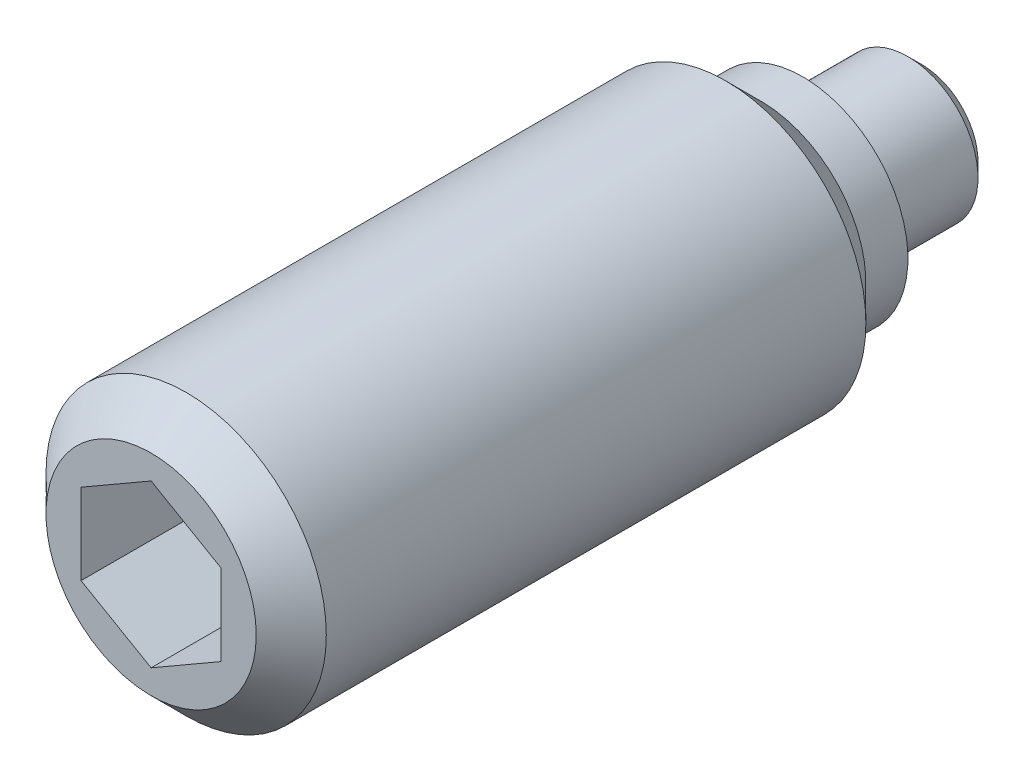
ISO-10303-21;
HEADER;
FILE_DESCRIPTION(('STEP AP214'),'2;1');
FILE_NAME('part.step','',(''),(''),'','','');
FILE_SCHEMA(('AUTOMOTIVE_DESIGN { 1 0 10303 214 1 1 1 1 }'));
ENDSEC;
DATA;
#1=APPLICATION_CONTEXT('core data for automotive mechanical design processes');
#2=APPLICATION_PROTOCOL_DEFINITION('international standard','automotive_design',2000,#1);
#3=PRODUCT_CONTEXT('',#1,'mechanical');
#4=PRODUCT('Part','Part','',(#3));
#5=PRODUCT_RELATED_PRODUCT_CATEGORY('part','',(#4));
#6=PRODUCT_DEFINITION_FORMATION('','',#4);
#7=PRODUCT_DEFINITION_CONTEXT('part definition',#1,'design');
#8=PRODUCT_DEFINITION('design','',#6,#7);
#9=PRODUCT_DEFINITION_SHAPE('','',#8);
#10=(LENGTH_UNIT() NAMED_UNIT(*) SI_UNIT(.MILLI.,.METRE.));
#11=(NAMED_UNIT(*) PLANE_ANGLE_UNIT() SI_UNIT($,.RADIAN.));
#12=(NAMED_UNIT(*) SI_UNIT($,.STERADIAN.) SOLID_ANGLE_UNIT());
#13=UNCERTAINTY_MEASURE_WITH_UNIT(LENGTH_MEASURE(1.E-05),#10,'distance_accuracy_value','');
#14=(GEOMETRIC_REPRESENTATION_CONTEXT(3) GLOBAL_UNCERTAINTY_ASSIGNED_CONTEXT((#13)) GLOBAL_UNIT_ASSIGNED_CONTEXT((#10,
#11,#12)) REPRESENTATION_CONTEXT('',''));
#15=CARTESIAN_POINT('',(0.,0.,0.));
#16=DIRECTION('',(0.,0.,1.));
#17=DIRECTION('',(1.,0.,0.));
#18=AXIS2_PLACEMENT_3D('',#15,#16,#17);
#19=CARTESIAN_POINT('',(0.,0.,0.));
#20=DIRECTION('',(0.,0.,-1.));
#21=DIRECTION('',(-1.,0.,0.));
#22=AXIS2_PLACEMENT_3D('',#19,#20,#21);
#23=CYLINDRICAL_SURFACE('',#22,1.);
#24=CARTESIAN_POINT('',(0.,0.,0.2));
#25=DIRECTION('',(0.,0.,-1.));
#26=DIRECTION('',(-1.,0.,0.));
#27=AXIS2_PLACEMENT_3D('',#24,#25,#26);
#28=CIRCLE('',#27,1.);
#29=CARTESIAN_POINT('',(-1.,0.,0.2));
#30=VERTEX_POINT('',#29);
#31=EDGE_CURVE('E133',#30,#30,#28,.T.);
#32=ORIENTED_EDGE('',*,*,#31,.F.);
#33=EDGE_LOOP('',(#32));
#34=FACE_BOUND('',#33,.T.);
#35=CARTESIAN_POINT('',(0.,0.,1.7));
#36=DIRECTION('',(0.,0.,-1.));
#37=DIRECTION('',(-1.,0.,0.));
#38=AXIS2_PLACEMENT_3D('',#35,#36,#37);
#39=CIRCLE('',#38,1.);
#40=CARTESIAN_POINT('',(-1.,0.,1.7));
#41=VERTEX_POINT('',#40);
#42=EDGE_CURVE('E127',#41,#41,#39,.T.);
#43=ORIENTED_EDGE('',*,*,#42,.T.);
#44=EDGE_LOOP('',(#43));
#45=FACE_BOUND('',#44,.T.);
#46=ADVANCED_FACE('F14',(#34,#45),#23,.T.);
#47=CARTESIAN_POINT('',(0.,0.,0.2));
#48=DIRECTION('',(0.,0.,1.));
#49=DIRECTION('',(1.,0.,0.));
#50=AXIS2_PLACEMENT_3D('',#47,#48,#49);
#51=CONICAL_SURFACE('',#50,1.,0.785398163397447);
#52=CARTESIAN_POINT('',(0.,0.,0.));
#53=DIRECTION('',(0.,0.,-1.));
#54=DIRECTION('',(-1.,0.,0.));
#55=AXIS2_PLACEMENT_3D('',#52,#53,#54);
#56=CIRCLE('',#55,0.8);
#57=CARTESIAN_POINT('',(-0.8,0.,0.));
#58=VERTEX_POINT('',#57);
#59=EDGE_CURVE('E130',#58,#58,#56,.T.);
#60=ORIENTED_EDGE('',*,*,#59,.F.);
#61=EDGE_LOOP('',(#60));
#62=FACE_BOUND('',#61,.T.);
#63=ORIENTED_EDGE('',*,*,#31,.T.);
#64=EDGE_LOOP('',(#63));
#65=FACE_BOUND('',#64,.T.);
#66=ADVANCED_FACE('F157',(#62,#65),#51,.T.);
#67=CARTESIAN_POINT('',(0.,0.8,0.));
#68=DIRECTION('',(0.,0.,1.));
#69=DIRECTION('',(1.,0.,0.));
#70=AXIS2_PLACEMENT_3D('',#67,#68,#69);
#71=PLANE('',#70);
#72=ORIENTED_EDGE('',*,*,#59,.T.);
#73=EDGE_LOOP('',(#72));
#74=FACE_BOUND('',#73,.T.);
#75=ADVANCED_FACE('F154',(#74),#71,.F.);
#76=CARTESIAN_POINT('',(0.,0.,1.7));
#77=DIRECTION('',(0.,0.,-1.));
#78=DIRECTION('',(-1.,0.,0.));
#79=AXIS2_PLACEMENT_3D('',#76,#77,#78);
#80=CYLINDRICAL_SURFACE('',#79,2.);
#81=CARTESIAN_POINT('',(0.,0.,2.8));
#82=DIRECTION('',(0.,0.,-1.));
#83=DIRECTION('',(-1.,0.,0.));
#84=AXIS2_PLACEMENT_3D('',#81,#82,#83);
#85=CIRCLE('',#84,2.);
#86=CARTESIAN_POINT('',(-2.,0.,2.8));
#87=VERTEX_POINT('',#86);
#88=EDGE_CURVE('E9',#87,#87,#85,.T.);
#89=ORIENTED_EDGE('',*,*,#88,.F.);
#90=EDGE_LOOP('',(#89));
#91=FACE_BOUND('',#90,.T.);
#92=CARTESIAN_POINT('',(0.,0.,10.5));
#93=DIRECTION('',(0.,0.,1.));
#94=DIRECTION('',(1.,0.,0.));
#95=AXIS2_PLACEMENT_3D('',#92,#93,#94);
#96=CIRCLE('',#95,2.);
#97=CARTESIAN_POINT('',(2.,0.,10.5));
#98=VERTEX_POINT('',#97);
#99=EDGE_CURVE('E124',#98,#98,#96,.T.);
#100=ORIENTED_EDGE('',*,*,#99,.F.);
#101=EDGE_LOOP('',(#100));
#102=FACE_BOUND('',#101,.T.);
#103=ADVANCED_FACE('F16',(#91,#102),#80,.T.);
#104=CARTESIAN_POINT('',(0.,0.,2.8));
#105=DIRECTION('',(0.,0.,1.));
#106=DIRECTION('',(1.,0.,0.));
#107=AXIS2_PLACEMENT_3D('',#104,#105,#106);
#108=CONICAL_SURFACE('',#107,2.,0.785398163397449);
#109=ORIENTED_EDGE('',*,*,#88,.T.);
#110=EDGE_LOOP('',(#109));
#111=FACE_BOUND('',#110,.T.);
#112=CARTESIAN_POINT('',(0.,0.,2.3));
#113=DIRECTION('',(0.,0.,-1.));
#114=DIRECTION('',(-1.,0.,0.));
#115=AXIS2_PLACEMENT_3D('',#112,#113,#114);
#116=CIRCLE('',#115,1.5);
#117=CARTESIAN_POINT('',(-1.5,0.,2.3));
#118=VERTEX_POINT('',#117);
#119=EDGE_CURVE('E22',#118,#118,#116,.T.);
#120=ORIENTED_EDGE('',*,*,#119,.F.);
#121=EDGE_LOOP('',(#120));
#122=FACE_BOUND('',#121,.T.);
#123=ADVANCED_FACE('F143',(#111,#122),#108,.T.);
#124=CARTESIAN_POINT('',(0.,0.,1.7));
#125=DIRECTION('',(0.,0.,-1.));
#126=DIRECTION('',(-1.,0.,0.));
#127=AXIS2_PLACEMENT_3D('',#124,#125,#126);
#128=CYLINDRICAL_SURFACE('',#127,1.5);
#129=CARTESIAN_POINT('',(0.,0.,1.7));
#130=DIRECTION('',(0.,0.,-1.));
#131=DIRECTION('',(-1.,0.,0.));
#132=AXIS2_PLACEMENT_3D('',#129,#130,#131);
#133=CIRCLE('',#132,1.5);
#134=CARTESIAN_POINT('',(-1.5,0.,1.7));
#135=VERTEX_POINT('',#134);
#136=EDGE_CURVE('E136',#135,#135,#133,.T.);
#137=ORIENTED_EDGE('',*,*,#136,.F.);
#138=EDGE_LOOP('',(#137));
#139=FACE_BOUND('',#138,.T.);
#140=ORIENTED_EDGE('',*,*,#119,.T.);
#141=EDGE_LOOP('',(#140));
#142=FACE_BOUND('',#141,.T.);
#143=ADVANCED_FACE('F141',(#139,#142),#128,.T.);
#144=CARTESIAN_POINT('',(0.,1.5,1.7));
#145=DIRECTION('',(0.,0.,1.));
#146=DIRECTION('',(1.,0.,0.));
#147=AXIS2_PLACEMENT_3D('',#144,#145,#146);
#148=PLANE('',#147);
#149=ORIENTED_EDGE('',*,*,#136,.T.);
#150=EDGE_LOOP('',(#149));
#151=FACE_BOUND('',#150,.T.);
#152=ORIENTED_EDGE('',*,*,#42,.F.);
#153=EDGE_LOOP('',(#152));
#154=FACE_BOUND('',#153,.T.);
#155=ADVANCED_FACE('F151',(#151,#154),#148,.F.);
#156=CARTESIAN_POINT('',(0.,-1.5,11.));
#157=DIRECTION('',(0.,0.,1.));
#158=DIRECTION('',(1.,0.,0.));
#159=AXIS2_PLACEMENT_3D('',#156,#157,#158);
#160=PLANE('',#159);
#161=DIRECTION('',(0.866025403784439,-0.5,0.));
#162=VECTOR('',#161,1.);
#163=CARTESIAN_POINT('',(-1.,-0.577350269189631,11.));
#164=LINE('',#163,#162);
#165=CARTESIAN_POINT('',(-1.,-0.577350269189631,11.));
#166=VERTEX_POINT('',#165);
#167=CARTESIAN_POINT('',(0.,-1.15470053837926,11.));
#168=VERTEX_POINT('',#167);
#169=EDGE_CURVE('E29',#166,#168,#164,.T.);
#170=ORIENTED_EDGE('',*,*,#169,.F.);
#171=DIRECTION('',(0.,-1.,0.));
#172=VECTOR('',#171,1.);
#173=CARTESIAN_POINT('',(-1.,0.577350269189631,11.));
#174=LINE('',#173,#172);
#175=CARTESIAN_POINT('',(-1.,0.577350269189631,11.));
#176=VERTEX_POINT('',#175);
#177=EDGE_CURVE('E112',#176,#166,#174,.T.);
#178=ORIENTED_EDGE('',*,*,#177,.F.);
#179=DIRECTION('',(-0.866025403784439,-0.5,0.));
#180=VECTOR('',#179,1.);
#181=CARTESIAN_POINT('',(0.,1.15470053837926,11.));
#182=LINE('',#181,#180);
#183=CARTESIAN_POINT('',(0.,1.15470053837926,11.));
#184=VERTEX_POINT('',#183);
#185=EDGE_CURVE('E110',#184,#176,#182,.T.);
#186=ORIENTED_EDGE('',*,*,#185,.F.);
#187=DIRECTION('',(-0.866025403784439,0.5,0.));
#188=VECTOR('',#187,1.);
#189=CARTESIAN_POINT('',(1.,0.577350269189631,11.));
#190=LINE('',#189,#188);
#191=CARTESIAN_POINT('',(1.,0.577350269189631,11.));
#192=VERTEX_POINT('',#191);
#193=EDGE_CURVE('E77',#192,#184,#190,.T.);
#194=ORIENTED_EDGE('',*,*,#193,.F.);
#195=DIRECTION('',(0.,1.,0.));
#196=VECTOR('',#195,1.);
#197=CARTESIAN_POINT('',(1.,-0.577350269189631,11.));
#198=LINE('',#197,#196);
#199=CARTESIAN_POINT('',(1.,-0.577350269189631,11.));
#200=VERTEX_POINT('',#199);
#201=EDGE_CURVE('E106',#200,#192,#198,.T.);
#202=ORIENTED_EDGE('',*,*,#201,.F.);
#203=DIRECTION('',(0.866025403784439,0.5,0.));
#204=VECTOR('',#203,1.);
#205=CARTESIAN_POINT('',(0.,-1.15470053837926,11.));
#206=LINE('',#205,#204);
#207=EDGE_CURVE('E103',#168,#200,#206,.T.);
#208=ORIENTED_EDGE('',*,*,#207,.F.);
#209=EDGE_LOOP('',(#170,#178,#186,#194,#202,#208));
#210=FACE_BOUND('',#209,.T.);
#211=CARTESIAN_POINT('',(0.,0.,11.));
#212=DIRECTION('',(0.,0.,1.));
#213=DIRECTION('',(1.,0.,0.));
#214=AXIS2_PLACEMENT_3D('',#211,#212,#213);
#215=CIRCLE('',#214,1.5);
#216=CARTESIAN_POINT('',(1.5,0.,11.));
#217=VERTEX_POINT('',#216);
#218=EDGE_CURVE('E116',#217,#217,#215,.T.);
#219=ORIENTED_EDGE('',*,*,#218,.T.);
#220=EDGE_LOOP('',(#219));
#221=FACE_BOUND('',#220,.T.);
#222=ADVANCED_FACE('F170',(#210,#221),#160,.T.);
#223=CARTESIAN_POINT('',(0.,0.,11.));
#224=DIRECTION('',(0.,0.,-1.));
#225=DIRECTION('',(-1.,0.,0.));
#226=AXIS2_PLACEMENT_3D('',#223,#224,#225);
#227=CONICAL_SURFACE('',#226,1.5,0.785398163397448);
#228=ORIENTED_EDGE('',*,*,#99,.T.);
#229=EDGE_LOOP('',(#228));
#230=FACE_BOUND('',#229,.T.);
#231=ORIENTED_EDGE('',*,*,#218,.F.);
#232=EDGE_LOOP('',(#231));
#233=FACE_BOUND('',#232,.T.);
#234=ADVANCED_FACE('F175',(#230,#233),#227,.T.);
#235=CARTESIAN_POINT('',(-1.,-0.577350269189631,8.5));
#236=DIRECTION('',(-0.5,-0.866025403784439,0.));
#237=DIRECTION('',(0.866025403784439,-0.5,0.));
#238=AXIS2_PLACEMENT_3D('',#235,#236,#237);
#239=PLANE('',#238);
#240=ORIENTED_EDGE('',*,*,#169,.T.);
#241=DIRECTION('',(0.,0.,1.));
#242=VECTOR('',#241,1.);
#243=CARTESIAN_POINT('',(0.,-1.15470053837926,8.5));
#244=LINE('',#243,#242);
#245=CARTESIAN_POINT('',(0.,-1.15470053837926,8.5));
#246=VERTEX_POINT('',#245);
#247=EDGE_CURVE('E59',#246,#168,#244,.T.);
#248=ORIENTED_EDGE('',*,*,#247,.F.);
#249=DIRECTION('',(0.866025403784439,-0.5,0.));
#250=VECTOR('',#249,1.);
#251=CARTESIAN_POINT('',(-1.,-0.577350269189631,8.5));
#252=LINE('',#251,#250);
#253=CARTESIAN_POINT('',(-1.,-0.577350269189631,8.5));
#254=VERTEX_POINT('',#253);
#255=EDGE_CURVE('E114',#254,#246,#252,.T.);
#256=ORIENTED_EDGE('',*,*,#255,.F.);
#257=DIRECTION('',(0.,0.,1.));
#258=VECTOR('',#257,1.);
#259=CARTESIAN_POINT('',(-1.,-0.577350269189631,8.5));
#260=LINE('',#259,#258);
#261=EDGE_CURVE('E37',#254,#166,#260,.T.);
#262=ORIENTED_EDGE('',*,*,#261,.T.);
#263=EDGE_LOOP('',(#240,#248,#256,#262));
#264=FACE_BOUND('',#263,.T.);
#265=ADVANCED_FACE('F184',(#264),#239,.F.);
#266=CARTESIAN_POINT('',(-1.,0.577350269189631,8.5));
#267=DIRECTION('',(-1.,0.,0.));
#268=DIRECTION('',(0.,0.,1.));
#269=AXIS2_PLACEMENT_3D('',#266,#267,#268);
#270=PLANE('',#269);
#271=ORIENTED_EDGE('',*,*,#177,.T.);
#272=ORIENTED_EDGE('',*,*,#261,.F.);
#273=DIRECTION('',(0.,-1.,0.));
#274=VECTOR('',#273,1.);
#275=CARTESIAN_POINT('',(-1.,0.577350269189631,8.5));
#276=LINE('',#275,#274);
#277=CARTESIAN_POINT('',(-1.,0.577350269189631,8.5));
#278=VERTEX_POINT('',#277);
#279=EDGE_CURVE('E89',#278,#254,#276,.T.);
#280=ORIENTED_EDGE('',*,*,#279,.F.);
#281=DIRECTION('',(0.,0.,1.));
#282=VECTOR('',#281,1.);
#283=CARTESIAN_POINT('',(-1.,0.577350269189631,8.5));
#284=LINE('',#283,#282);
#285=EDGE_CURVE('E81',#278,#176,#284,.T.);
#286=ORIENTED_EDGE('',*,*,#285,.T.);
#287=EDGE_LOOP('',(#271,#272,#280,#286));
#288=FACE_BOUND('',#287,.T.);
#289=ADVANCED_FACE('F244',(#288),#270,.F.);
#290=CARTESIAN_POINT('',(0.,1.15470053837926,8.5));
#291=DIRECTION('',(-0.5,0.866025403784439,0.));
#292=DIRECTION('',(-0.866025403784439,-0.5,0.));
#293=AXIS2_PLACEMENT_3D('',#290,#291,#292);
#294=PLANE('',#293);
#295=ORIENTED_EDGE('',*,*,#185,.T.);
#296=ORIENTED_EDGE('',*,*,#285,.F.);
#297=DIRECTION('',(-0.866025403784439,-0.5,0.));
#298=VECTOR('',#297,1.);
#299=CARTESIAN_POINT('',(0.,1.15470053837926,8.5));
#300=LINE('',#299,#298);
#301=CARTESIAN_POINT('',(0.,1.15470053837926,8.5));
#302=VERTEX_POINT('',#301);
#303=EDGE_CURVE('E85',#302,#278,#300,.T.);
#304=ORIENTED_EDGE('',*,*,#303,.F.);
#305=DIRECTION('',(0.,0.,1.));
#306=VECTOR('',#305,1.);
#307=CARTESIAN_POINT('',(0.,1.15470053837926,8.5));
#308=LINE('',#307,#306);
#309=EDGE_CURVE('E70',#302,#184,#308,.T.);
#310=ORIENTED_EDGE('',*,*,#309,.T.);
#311=EDGE_LOOP('',(#295,#296,#304,#310));
#312=FACE_BOUND('',#311,.T.);
#313=ADVANCED_FACE('F86',(#312),#294,.F.);
#314=CARTESIAN_POINT('',(1.,0.577350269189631,8.5));
#315=DIRECTION('',(0.5,0.866025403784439,0.));
#316=DIRECTION('',(-0.866025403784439,0.5,0.));
#317=AXIS2_PLACEMENT_3D('',#314,#315,#316);
#318=PLANE('',#317);
#319=ORIENTED_EDGE('',*,*,#193,.T.);
#320=ORIENTED_EDGE('',*,*,#309,.F.);
#321=DIRECTION('',(-0.866025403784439,0.5,0.));
#322=VECTOR('',#321,1.);
#323=CARTESIAN_POINT('',(1.,0.577350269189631,8.5));
#324=LINE('',#323,#322);
#325=CARTESIAN_POINT('',(1.,0.577350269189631,8.5));
#326=VERTEX_POINT('',#325);
#327=EDGE_CURVE('E74',#326,#302,#324,.T.);
#328=ORIENTED_EDGE('',*,*,#327,.F.);
#329=DIRECTION('',(0.,0.,1.));
#330=VECTOR('',#329,1.);
#331=CARTESIAN_POINT('',(1.,0.577350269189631,8.5));
#332=LINE('',#331,#330);
#333=EDGE_CURVE('E82',#326,#192,#332,.T.);
#334=ORIENTED_EDGE('',*,*,#333,.T.);
#335=EDGE_LOOP('',(#319,#320,#328,#334));
#336=FACE_BOUND('',#335,.T.);
#337=ADVANCED_FACE('F72',(#336),#318,.F.);
#338=CARTESIAN_POINT('',(1.,-0.577350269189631,8.5));
#339=DIRECTION('',(1.,0.,0.));
#340=DIRECTION('',(0.,0.,-1.));
#341=AXIS2_PLACEMENT_3D('',#338,#339,#340);
#342=PLANE('',#341);
#343=ORIENTED_EDGE('',*,*,#201,.T.);
#344=ORIENTED_EDGE('',*,*,#333,.F.);
#345=DIRECTION('',(0.,1.,0.));
#346=VECTOR('',#345,1.);
#347=CARTESIAN_POINT('',(1.,-0.577350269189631,8.5));
#348=LINE('',#347,#346);
#349=CARTESIAN_POINT('',(1.,-0.577350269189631,8.5));
#350=VERTEX_POINT('',#349);
#351=EDGE_CURVE('E95',#350,#326,#348,.T.);
#352=ORIENTED_EDGE('',*,*,#351,.F.);
#353=DIRECTION('',(0.,0.,1.));
#354=VECTOR('',#353,1.);
#355=CARTESIAN_POINT('',(1.,-0.577350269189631,8.5));
#356=LINE('',#355,#354);
#357=EDGE_CURVE('E119',#350,#200,#356,.T.);
#358=ORIENTED_EDGE('',*,*,#357,.T.);
#359=EDGE_LOOP('',(#343,#344,#352,#358));
#360=FACE_BOUND('',#359,.T.);
#361=ADVANCED_FACE('F268',(#360),#342,.F.);
#362=CARTESIAN_POINT('',(0.,-1.15470053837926,8.5));
#363=DIRECTION('',(0.5,-0.866025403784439,0.));
#364=DIRECTION('',(0.866025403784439,0.5,0.));
#365=AXIS2_PLACEMENT_3D('',#362,#363,#364);
#366=PLANE('',#365);
#367=ORIENTED_EDGE('',*,*,#207,.T.);
#368=ORIENTED_EDGE('',*,*,#357,.F.);
#369=DIRECTION('',(0.866025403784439,0.5,0.));
#370=VECTOR('',#369,1.);
#371=CARTESIAN_POINT('',(0.,-1.15470053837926,8.5));
#372=LINE('',#371,#370);
#373=EDGE_CURVE('E97',#246,#350,#372,.T.);
#374=ORIENTED_EDGE('',*,*,#373,.F.);
#375=ORIENTED_EDGE('',*,*,#247,.T.);
#376=EDGE_LOOP('',(#367,#368,#374,#375));
#377=FACE_BOUND('',#376,.T.);
#378=ADVANCED_FACE('F277',(#377),#366,.F.);
#379=CARTESIAN_POINT('',(0.,0.,8.5));
#380=DIRECTION('',(0.,0.,1.));
#381=DIRECTION('',(1.,0.,0.));
#382=AXIS2_PLACEMENT_3D('',#379,#380,#381);
#383=PLANE('',#382);
#384=ORIENTED_EDGE('',*,*,#255,.T.);
#385=ORIENTED_EDGE('',*,*,#373,.T.);
#386=ORIENTED_EDGE('',*,*,#351,.T.);
#387=ORIENTED_EDGE('',*,*,#327,.T.);
#388=ORIENTED_EDGE('',*,*,#303,.T.);
#389=ORIENTED_EDGE('',*,*,#279,.T.);
#390=EDGE_LOOP('',(#384,#385,#386,#387,#388,#389));
#391=FACE_BOUND('',#390,.T.);
#392=ADVANCED_FACE('F92',(#391),#383,.T.);
#393=CLOSED_SHELL('',(#46,#66,#75,#103,#123,#143,#155,#222,#234,#265,#289,#313,#337,#361,#378,#392));
#394=MANIFOLD_SOLID_BREP('B1',#393);
#395=ADVANCED_BREP_SHAPE_REPRESENTATION('',(#18,#394),#14);
#396=SHAPE_DEFINITION_REPRESENTATION(#9,#395);
ENDSEC;
END-ISO-10303-21;
